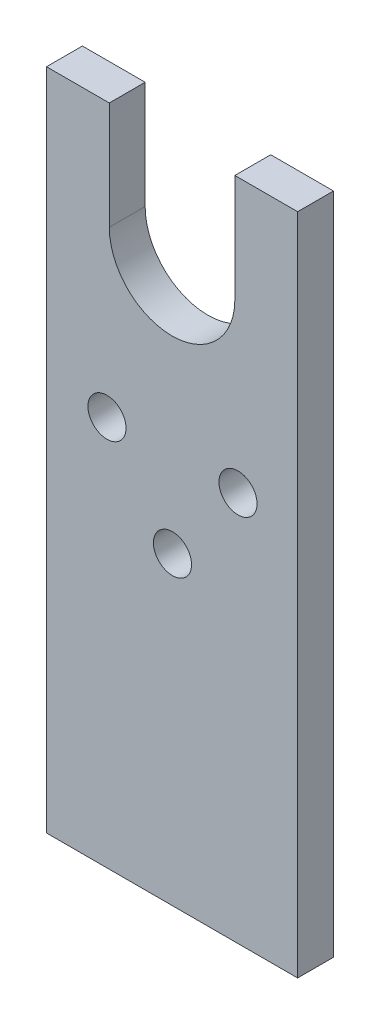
ISO-10303-21;
HEADER;
FILE_DESCRIPTION(('STEP AP214'),'2;1');
FILE_NAME('part.step','',(''),(''),'','','');
FILE_SCHEMA(('AUTOMOTIVE_DESIGN { 1 0 10303 214 1 1 1 1 }'));
ENDSEC;
DATA;
#1=APPLICATION_CONTEXT('core data for automotive mechanical design processes');
#2=APPLICATION_PROTOCOL_DEFINITION('international standard','automotive_design',2000,#1);
#3=PRODUCT_CONTEXT('',#1,'mechanical');
#4=PRODUCT('Part','Part','',(#3));
#5=PRODUCT_RELATED_PRODUCT_CATEGORY('part','',(#4));
#6=PRODUCT_DEFINITION_FORMATION('','',#4);
#7=PRODUCT_DEFINITION_CONTEXT('part definition',#1,'design');
#8=PRODUCT_DEFINITION('design','',#6,#7);
#9=PRODUCT_DEFINITION_SHAPE('','',#8);
#10=(LENGTH_UNIT() NAMED_UNIT(*) SI_UNIT(.MILLI.,.METRE.));
#11=(NAMED_UNIT(*) PLANE_ANGLE_UNIT() SI_UNIT($,.RADIAN.));
#12=(NAMED_UNIT(*) SI_UNIT($,.STERADIAN.) SOLID_ANGLE_UNIT());
#13=UNCERTAINTY_MEASURE_WITH_UNIT(LENGTH_MEASURE(1.E-05),#10,'distance_accuracy_value','');
#14=(GEOMETRIC_REPRESENTATION_CONTEXT(3) GLOBAL_UNCERTAINTY_ASSIGNED_CONTEXT((#13)) GLOBAL_UNIT_ASSIGNED_CONTEXT((#10,
#11,#12)) REPRESENTATION_CONTEXT('',''));
#15=CARTESIAN_POINT('',(0.,0.,0.));
#16=DIRECTION('',(0.,0.,1.));
#17=DIRECTION('',(1.,0.,0.));
#18=AXIS2_PLACEMENT_3D('',#15,#16,#17);
#19=CARTESIAN_POINT('',(-44.4500000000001,-12.7,12.7));
#20=DIRECTION('',(0.,1.,0.));
#21=DIRECTION('',(0.,0.,1.));
#22=AXIS2_PLACEMENT_3D('',#19,#20,#21);
#23=PLANE('',#22);
#24=DIRECTION('',(1.,0.,0.));
#25=VECTOR('',#24,1.);
#26=CARTESIAN_POINT('',(-44.4500000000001,-12.7,12.7));
#27=LINE('',#26,#25);
#28=CARTESIAN_POINT('',(-44.4500000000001,-12.7,12.7));
#29=VERTEX_POINT('',#28);
#30=CARTESIAN_POINT('',(-22.2250000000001,-12.7,12.6999999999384));
#31=VERTEX_POINT('',#30);
#32=EDGE_CURVE('E166',#29,#31,#27,.T.);
#33=ORIENTED_EDGE('',*,*,#32,.T.);
#34=DIRECTION('',(0.,0.,1.));
#35=VECTOR('',#34,1.);
#36=CARTESIAN_POINT('',(-22.2250000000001,-12.7,0.));
#37=LINE('',#36,#35);
#38=CARTESIAN_POINT('',(-22.2250000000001,-12.7,0.));
#39=VERTEX_POINT('',#38);
#40=EDGE_CURVE('E126',#39,#31,#37,.T.);
#41=ORIENTED_EDGE('',*,*,#40,.F.);
#42=DIRECTION('',(1.,0.,0.));
#43=VECTOR('',#42,1.);
#44=CARTESIAN_POINT('',(-44.4500000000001,-12.7,0.));
#45=LINE('',#44,#43);
#46=CARTESIAN_POINT('',(-44.4500000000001,-12.7,0.));
#47=VERTEX_POINT('',#46);
#48=EDGE_CURVE('E156',#47,#39,#45,.T.);
#49=ORIENTED_EDGE('',*,*,#48,.F.);
#50=DIRECTION('',(0.,0.,-1.));
#51=VECTOR('',#50,1.);
#52=CARTESIAN_POINT('',(-44.4500000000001,-12.7,12.7));
#53=LINE('',#52,#51);
#54=EDGE_CURVE('E53',#29,#47,#53,.T.);
#55=ORIENTED_EDGE('',*,*,#54,.F.);
#56=EDGE_LOOP('',(#33,#41,#49,#55));
#57=FACE_BOUND('',#56,.T.);
#58=ADVANCED_FACE('F30',(#57),#23,.T.);
#59=CARTESIAN_POINT('',(22.2249999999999,-12.7,0.));
#60=VERTEX_POINT('',#59);
#61=CARTESIAN_POINT('',(44.45,-12.7,0.));
#62=VERTEX_POINT('',#61);
#63=EDGE_CURVE('E155',#60,#62,#45,.T.);
#64=ORIENTED_EDGE('',*,*,#63,.F.);
#65=DIRECTION('',(0.,0.,1.));
#66=VECTOR('',#65,1.);
#67=CARTESIAN_POINT('',(22.2249999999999,-12.7,0.));
#68=LINE('',#67,#66);
#69=CARTESIAN_POINT('',(22.2249999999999,-12.7,12.6999999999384));
#70=VERTEX_POINT('',#69);
#71=EDGE_CURVE('E45',#60,#70,#68,.T.);
#72=ORIENTED_EDGE('',*,*,#71,.T.);
#73=CARTESIAN_POINT('',(44.45,-12.7,12.7));
#74=VERTEX_POINT('',#73);
#75=EDGE_CURVE('E115',#70,#74,#27,.T.);
#76=ORIENTED_EDGE('',*,*,#75,.T.);
#77=DIRECTION('',(0.,0.,-1.));
#78=VECTOR('',#77,1.);
#79=CARTESIAN_POINT('',(44.45,-12.7,12.7));
#80=LINE('',#79,#78);
#81=EDGE_CURVE('E169',#74,#62,#80,.T.);
#82=ORIENTED_EDGE('',*,*,#81,.T.);
#83=EDGE_LOOP('',(#64,#72,#76,#82));
#84=FACE_BOUND('',#83,.T.);
#85=ADVANCED_FACE('F192',(#84),#23,.T.);
#86=CARTESIAN_POINT('',(-44.4500000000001,-247.65,12.7));
#87=DIRECTION('',(0.,0.,-1.));
#88=DIRECTION('',(-1.,0.,0.));
#89=AXIS2_PLACEMENT_3D('',#86,#87,#88);
#90=PLANE('',#89);
#91=CARTESIAN_POINT('',(0.148789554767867,-139.700762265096,12.6999999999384));
#92=DIRECTION('',(0.,0.,1.));
#93=DIRECTION('',(1.,0.,0.));
#94=AXIS2_PLACEMENT_3D('',#91,#92,#93);
#95=CIRCLE('',#94,6.74369999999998);
#96=CARTESIAN_POINT('',(6.89248955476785,-139.700762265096,12.6999999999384));
#97=VERTEX_POINT('',#96);
#98=EDGE_CURVE('E140',#97,#97,#95,.T.);
#99=ORIENTED_EDGE('',*,*,#98,.F.);
#100=EDGE_LOOP('',(#99));
#101=FACE_BOUND('',#100,.T.);
#102=CARTESIAN_POINT('',(-23.0450208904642,-109.474,12.6999999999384));
#103=DIRECTION('',(0.,0.,1.));
#104=DIRECTION('',(1.,0.,0.));
#105=AXIS2_PLACEMENT_3D('',#102,#103,#104);
#106=CIRCLE('',#105,6.7437);
#107=CARTESIAN_POINT('',(-16.3013208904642,-109.474,12.6999999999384));
#108=VERTEX_POINT('',#107);
#109=EDGE_CURVE('E134',#108,#108,#106,.T.);
#110=ORIENTED_EDGE('',*,*,#109,.F.);
#111=EDGE_LOOP('',(#110));
#112=FACE_BOUND('',#111,.T.);
#113=CARTESIAN_POINT('',(23.3426,-109.474,12.6999999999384));
#114=DIRECTION('',(0.,0.,1.));
#115=DIRECTION('',(1.,0.,0.));
#116=AXIS2_PLACEMENT_3D('',#113,#114,#115);
#117=CIRCLE('',#116,6.7437);
#118=CARTESIAN_POINT('',(30.0863,-109.474,12.6999999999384));
#119=VERTEX_POINT('',#118);
#120=EDGE_CURVE('E125',#119,#119,#117,.T.);
#121=ORIENTED_EDGE('',*,*,#120,.F.);
#122=EDGE_LOOP('',(#121));
#123=FACE_BOUND('',#122,.T.);
#124=DIRECTION('',(0.,1.,0.));
#125=VECTOR('',#124,1.);
#126=CARTESIAN_POINT('',(-22.2250000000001,-50.8,12.6999999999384));
#127=LINE('',#126,#125);
#128=CARTESIAN_POINT('',(-22.2250000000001,-50.8,12.6999999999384));
#129=VERTEX_POINT('',#128);
#130=EDGE_CURVE('E116',#129,#31,#127,.T.);
#131=ORIENTED_EDGE('',*,*,#130,.T.);
#132=ORIENTED_EDGE('',*,*,#32,.F.);
#133=DIRECTION('',(0.,-1.,0.));
#134=VECTOR('',#133,1.);
#135=CARTESIAN_POINT('',(-44.4500000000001,-12.7,12.7));
#136=LINE('',#135,#134);
#137=CARTESIAN_POINT('',(-44.4500000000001,-247.65,12.7));
#138=VERTEX_POINT('',#137);
#139=EDGE_CURVE('E159',#29,#138,#136,.T.);
#140=ORIENTED_EDGE('',*,*,#139,.T.);
#141=DIRECTION('',(-1.,0.,0.));
#142=VECTOR('',#141,1.);
#143=CARTESIAN_POINT('',(44.45,-247.65,12.7));
#144=LINE('',#143,#142);
#145=CARTESIAN_POINT('',(44.45,-247.65,12.7));
#146=VERTEX_POINT('',#145);
#147=EDGE_CURVE('E161',#146,#138,#144,.T.);
#148=ORIENTED_EDGE('',*,*,#147,.F.);
#149=DIRECTION('',(0.,1.,0.));
#150=VECTOR('',#149,1.);
#151=CARTESIAN_POINT('',(44.45,-247.65,12.7));
#152=LINE('',#151,#150);
#153=EDGE_CURVE('E164',#146,#74,#152,.T.);
#154=ORIENTED_EDGE('',*,*,#153,.T.);
#155=ORIENTED_EDGE('',*,*,#75,.F.);
#156=DIRECTION('',(0.,-1.,0.));
#157=VECTOR('',#156,1.);
#158=CARTESIAN_POINT('',(22.2249999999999,-12.7,12.6999999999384));
#159=LINE('',#158,#157);
#160=CARTESIAN_POINT('',(22.2249999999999,-50.8,12.6999999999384));
#161=VERTEX_POINT('',#160);
#162=EDGE_CURVE('E97',#70,#161,#159,.T.);
#163=ORIENTED_EDGE('',*,*,#162,.T.);
#164=CARTESIAN_POINT('',(0.,-50.8,12.6999999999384));
#165=DIRECTION('',(0.,0.,1.));
#166=DIRECTION('',(1.,0.,0.));
#167=AXIS2_PLACEMENT_3D('',#164,#165,#166);
#168=CIRCLE('',#167,22.225);
#169=EDGE_CURVE('E105',#129,#161,#168,.T.);
#170=ORIENTED_EDGE('',*,*,#169,.F.);
#171=EDGE_LOOP('',(#131,#132,#140,#148,#154,#155,#163,#170));
#172=FACE_BOUND('',#171,.T.);
#173=ADVANCED_FACE('F113',(#101,#112,#123,#172),#90,.F.);
#174=CARTESIAN_POINT('',(-44.4500000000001,-247.65,0.));
#175=DIRECTION('',(0.,0.,-1.));
#176=DIRECTION('',(-1.,0.,0.));
#177=AXIS2_PLACEMENT_3D('',#174,#175,#176);
#178=PLANE('',#177);
#179=CARTESIAN_POINT('',(0.148789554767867,-139.700762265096,0.));
#180=DIRECTION('',(0.,0.,1.));
#181=DIRECTION('',(1.,0.,0.));
#182=AXIS2_PLACEMENT_3D('',#179,#180,#181);
#183=CIRCLE('',#182,6.74369999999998);
#184=CARTESIAN_POINT('',(6.89248955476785,-139.700762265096,0.));
#185=VERTEX_POINT('',#184);
#186=EDGE_CURVE('E143',#185,#185,#183,.T.);
#187=ORIENTED_EDGE('',*,*,#186,.T.);
#188=EDGE_LOOP('',(#187));
#189=FACE_BOUND('',#188,.T.);
#190=CARTESIAN_POINT('',(-23.0450208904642,-109.474,0.));
#191=DIRECTION('',(0.,0.,1.));
#192=DIRECTION('',(1.,0.,0.));
#193=AXIS2_PLACEMENT_3D('',#190,#191,#192);
#194=CIRCLE('',#193,6.7437);
#195=CARTESIAN_POINT('',(-16.3013208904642,-109.474,0.));
#196=VERTEX_POINT('',#195);
#197=EDGE_CURVE('E137',#196,#196,#194,.T.);
#198=ORIENTED_EDGE('',*,*,#197,.T.);
#199=EDGE_LOOP('',(#198));
#200=FACE_BOUND('',#199,.T.);
#201=CARTESIAN_POINT('',(23.3426,-109.474,0.));
#202=DIRECTION('',(0.,0.,1.));
#203=DIRECTION('',(1.,0.,0.));
#204=AXIS2_PLACEMENT_3D('',#201,#202,#203);
#205=CIRCLE('',#204,6.7437);
#206=CARTESIAN_POINT('',(30.0863,-109.474,0.));
#207=VERTEX_POINT('',#206);
#208=EDGE_CURVE('E131',#207,#207,#205,.T.);
#209=ORIENTED_EDGE('',*,*,#208,.T.);
#210=EDGE_LOOP('',(#209));
#211=FACE_BOUND('',#210,.T.);
#212=ORIENTED_EDGE('',*,*,#48,.T.);
#213=DIRECTION('',(0.,1.,0.));
#214=VECTOR('',#213,1.);
#215=CARTESIAN_POINT('',(-22.2250000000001,-50.8,0.));
#216=LINE('',#215,#214);
#217=CARTESIAN_POINT('',(-22.2250000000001,-50.8,0.));
#218=VERTEX_POINT('',#217);
#219=EDGE_CURVE('E102',#218,#39,#216,.T.);
#220=ORIENTED_EDGE('',*,*,#219,.F.);
#221=CARTESIAN_POINT('',(0.,-50.8,0.));
#222=DIRECTION('',(0.,0.,1.));
#223=DIRECTION('',(1.,0.,0.));
#224=AXIS2_PLACEMENT_3D('',#221,#222,#223);
#225=CIRCLE('',#224,22.225);
#226=CARTESIAN_POINT('',(22.2249999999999,-50.8,0.));
#227=VERTEX_POINT('',#226);
#228=EDGE_CURVE('E118',#218,#227,#225,.T.);
#229=ORIENTED_EDGE('',*,*,#228,.T.);
#230=DIRECTION('',(0.,-1.,0.));
#231=VECTOR('',#230,1.);
#232=CARTESIAN_POINT('',(22.2249999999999,-12.7,0.));
#233=LINE('',#232,#231);
#234=EDGE_CURVE('E98',#60,#227,#233,.T.);
#235=ORIENTED_EDGE('',*,*,#234,.F.);
#236=ORIENTED_EDGE('',*,*,#63,.T.);
#237=DIRECTION('',(0.,1.,0.));
#238=VECTOR('',#237,1.);
#239=CARTESIAN_POINT('',(44.45,-247.65,0.));
#240=LINE('',#239,#238);
#241=CARTESIAN_POINT('',(44.45,-247.65,0.));
#242=VERTEX_POINT('',#241);
#243=EDGE_CURVE('E152',#242,#62,#240,.T.);
#244=ORIENTED_EDGE('',*,*,#243,.F.);
#245=DIRECTION('',(-1.,0.,0.));
#246=VECTOR('',#245,1.);
#247=CARTESIAN_POINT('',(44.45,-247.65,0.));
#248=LINE('',#247,#246);
#249=CARTESIAN_POINT('',(-44.4500000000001,-247.65,0.));
#250=VERTEX_POINT('',#249);
#251=EDGE_CURVE('E149',#242,#250,#248,.T.);
#252=ORIENTED_EDGE('',*,*,#251,.T.);
#253=DIRECTION('',(0.,-1.,0.));
#254=VECTOR('',#253,1.);
#255=CARTESIAN_POINT('',(-44.4500000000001,-12.7,0.));
#256=LINE('',#255,#254);
#257=EDGE_CURVE('E146',#47,#250,#256,.T.);
#258=ORIENTED_EDGE('',*,*,#257,.F.);
#259=EDGE_LOOP('',(#212,#220,#229,#235,#236,#244,#252,#258));
#260=FACE_BOUND('',#259,.T.);
#261=ADVANCED_FACE('F180',(#189,#200,#211,#260),#178,.T.);
#262=CARTESIAN_POINT('',(-44.4500000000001,-12.7,12.7));
#263=DIRECTION('',(1.,0.,0.));
#264=DIRECTION('',(0.,1.,0.));
#265=AXIS2_PLACEMENT_3D('',#262,#263,#264);
#266=PLANE('',#265);
#267=ORIENTED_EDGE('',*,*,#257,.T.);
#268=DIRECTION('',(0.,0.,-1.));
#269=VECTOR('',#268,1.);
#270=CARTESIAN_POINT('',(-44.4500000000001,-247.65,12.7));
#271=LINE('',#270,#269);
#272=EDGE_CURVE('E11',#138,#250,#271,.T.);
#273=ORIENTED_EDGE('',*,*,#272,.F.);
#274=ORIENTED_EDGE('',*,*,#139,.F.);
#275=ORIENTED_EDGE('',*,*,#54,.T.);
#276=EDGE_LOOP('',(#267,#273,#274,#275));
#277=FACE_BOUND('',#276,.T.);
#278=ADVANCED_FACE('F32',(#277),#266,.F.);
#279=CARTESIAN_POINT('',(44.45,-247.65,12.7));
#280=DIRECTION('',(0.,-1.,0.));
#281=DIRECTION('',(0.,0.,-1.));
#282=AXIS2_PLACEMENT_3D('',#279,#280,#281);
#283=PLANE('',#282);
#284=ORIENTED_EDGE('',*,*,#251,.F.);
#285=DIRECTION('',(0.,0.,-1.));
#286=VECTOR('',#285,1.);
#287=CARTESIAN_POINT('',(44.45,-247.65,12.7));
#288=LINE('',#287,#286);
#289=EDGE_CURVE('E38',#146,#242,#288,.T.);
#290=ORIENTED_EDGE('',*,*,#289,.F.);
#291=ORIENTED_EDGE('',*,*,#147,.T.);
#292=ORIENTED_EDGE('',*,*,#272,.T.);
#293=EDGE_LOOP('',(#284,#290,#291,#292));
#294=FACE_BOUND('',#293,.T.);
#295=ADVANCED_FACE('F183',(#294),#283,.T.);
#296=CARTESIAN_POINT('',(44.45,-247.65,12.7));
#297=DIRECTION('',(-1.,0.,0.));
#298=DIRECTION('',(0.,0.,1.));
#299=AXIS2_PLACEMENT_3D('',#296,#297,#298);
#300=PLANE('',#299);
#301=ORIENTED_EDGE('',*,*,#243,.T.);
#302=ORIENTED_EDGE('',*,*,#81,.F.);
#303=ORIENTED_EDGE('',*,*,#153,.F.);
#304=ORIENTED_EDGE('',*,*,#289,.T.);
#305=EDGE_LOOP('',(#301,#302,#303,#304));
#306=FACE_BOUND('',#305,.T.);
#307=ADVANCED_FACE('F174',(#306),#300,.F.);
#308=CARTESIAN_POINT('',(0.148789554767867,-139.700762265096,0.));
#309=DIRECTION('',(0.,0.,1.));
#310=DIRECTION('',(1.,0.,0.));
#311=AXIS2_PLACEMENT_3D('',#308,#309,#310);
#312=CYLINDRICAL_SURFACE('',#311,6.74369999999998);
#313=ORIENTED_EDGE('',*,*,#186,.F.);
#314=EDGE_LOOP('',(#313));
#315=FACE_BOUND('',#314,.T.);
#316=ORIENTED_EDGE('',*,*,#98,.T.);
#317=EDGE_LOOP('',(#316));
#318=FACE_BOUND('',#317,.T.);
#319=ADVANCED_FACE('F204',(#315,#318),#312,.F.);
#320=CARTESIAN_POINT('',(-23.0450208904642,-109.474,0.));
#321=DIRECTION('',(0.,0.,1.));
#322=DIRECTION('',(1.,0.,0.));
#323=AXIS2_PLACEMENT_3D('',#320,#321,#322);
#324=CYLINDRICAL_SURFACE('',#323,6.7437);
#325=ORIENTED_EDGE('',*,*,#197,.F.);
#326=EDGE_LOOP('',(#325));
#327=FACE_BOUND('',#326,.T.);
#328=ORIENTED_EDGE('',*,*,#109,.T.);
#329=EDGE_LOOP('',(#328));
#330=FACE_BOUND('',#329,.T.);
#331=ADVANCED_FACE('F219',(#327,#330),#324,.F.);
#332=CARTESIAN_POINT('',(23.3426,-109.474,0.));
#333=DIRECTION('',(0.,0.,1.));
#334=DIRECTION('',(1.,0.,0.));
#335=AXIS2_PLACEMENT_3D('',#332,#333,#334);
#336=CYLINDRICAL_SURFACE('',#335,6.7437);
#337=ORIENTED_EDGE('',*,*,#208,.F.);
#338=EDGE_LOOP('',(#337));
#339=FACE_BOUND('',#338,.T.);
#340=ORIENTED_EDGE('',*,*,#120,.T.);
#341=EDGE_LOOP('',(#340));
#342=FACE_BOUND('',#341,.T.);
#343=ADVANCED_FACE('F223',(#339,#342),#336,.F.);
#344=CARTESIAN_POINT('',(0.,-50.8,0.));
#345=DIRECTION('',(0.,0.,1.));
#346=DIRECTION('',(1.,0.,0.));
#347=AXIS2_PLACEMENT_3D('',#344,#345,#346);
#348=CYLINDRICAL_SURFACE('',#347,22.225);
#349=ORIENTED_EDGE('',*,*,#169,.T.);
#350=DIRECTION('',(0.,0.,1.));
#351=VECTOR('',#350,1.);
#352=CARTESIAN_POINT('',(22.2249999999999,-50.8,0.));
#353=LINE('',#352,#351);
#354=EDGE_CURVE('E93',#227,#161,#353,.T.);
#355=ORIENTED_EDGE('',*,*,#354,.F.);
#356=ORIENTED_EDGE('',*,*,#228,.F.);
#357=DIRECTION('',(0.,0.,1.));
#358=VECTOR('',#357,1.);
#359=CARTESIAN_POINT('',(-22.2250000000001,-50.8,0.));
#360=LINE('',#359,#358);
#361=EDGE_CURVE('E107',#218,#129,#360,.T.);
#362=ORIENTED_EDGE('',*,*,#361,.T.);
#363=EDGE_LOOP('',(#349,#355,#356,#362));
#364=FACE_BOUND('',#363,.T.);
#365=ADVANCED_FACE('F106',(#364),#348,.F.);
#366=CARTESIAN_POINT('',(-22.2250000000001,-50.8,0.));
#367=DIRECTION('',(1.,0.,0.));
#368=DIRECTION('',(0.,0.,-1.));
#369=AXIS2_PLACEMENT_3D('',#366,#367,#368);
#370=PLANE('',#369);
#371=ORIENTED_EDGE('',*,*,#130,.F.);
#372=ORIENTED_EDGE('',*,*,#361,.F.);
#373=ORIENTED_EDGE('',*,*,#219,.T.);
#374=ORIENTED_EDGE('',*,*,#40,.T.);
#375=EDGE_LOOP('',(#371,#372,#373,#374));
#376=FACE_BOUND('',#375,.T.);
#377=ADVANCED_FACE('F190',(#376),#370,.T.);
#378=CARTESIAN_POINT('',(22.2249999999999,-12.7,0.));
#379=DIRECTION('',(-1.,0.,0.));
#380=DIRECTION('',(0.,-1.,0.));
#381=AXIS2_PLACEMENT_3D('',#378,#379,#380);
#382=PLANE('',#381);
#383=ORIENTED_EDGE('',*,*,#162,.F.);
#384=ORIENTED_EDGE('',*,*,#71,.F.);
#385=ORIENTED_EDGE('',*,*,#234,.T.);
#386=ORIENTED_EDGE('',*,*,#354,.T.);
#387=EDGE_LOOP('',(#383,#384,#385,#386));
#388=FACE_BOUND('',#387,.T.);
#389=ADVANCED_FACE('F95',(#388),#382,.T.);
#390=CLOSED_SHELL('',(#58,#85,#173,#261,#278,#295,#307,#319,#331,#343,#365,#377,#389));
#391=MANIFOLD_SOLID_BREP('B2',#390);
#392=ADVANCED_BREP_SHAPE_REPRESENTATION('',(#18,#391),#14);
#393=SHAPE_DEFINITION_REPRESENTATION(#9,#392);
ENDSEC;
END-ISO-10303-21;
